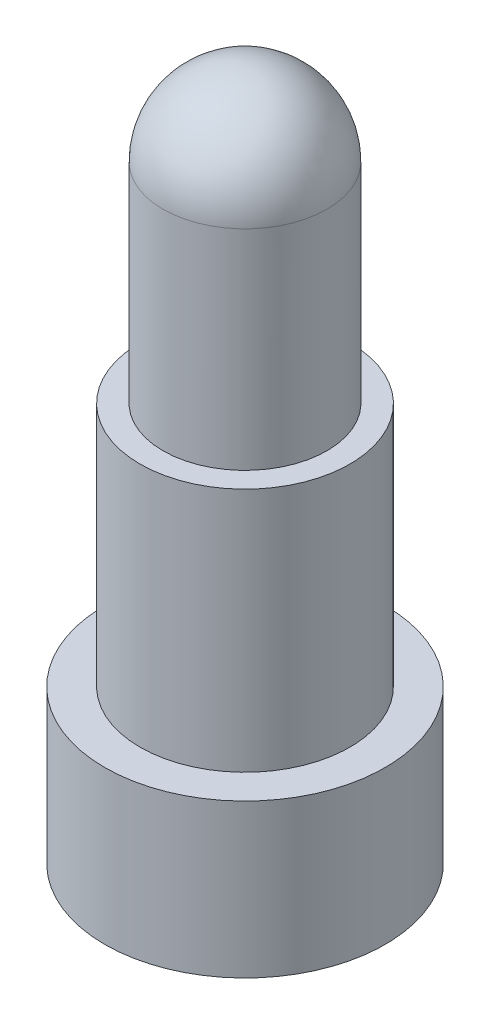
from build123d import *


with BuildPart() as part:
    # Sketch1 → Revolve1 (revolve)
    with BuildSketch(Plane.XY, mode=Mode.PRIVATE) as revolve1_sk:
        with BuildLine():
            Line((0, 0), (-0.915, 0))
            Line((-0.915, 0), (-0.915, 1))
            Line((-0.915, 1), (-0.685, 1))
            Line((-0.685, 1), (-0.685, 2.6))
            Line((-0.685, 2.6), (-0.535, 2.6))
            Line((-0.535, 2.6), (-0.535, 3.965))
            ThreePointArc((-0.535, 3.965), (-0.378302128, 4.343302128), (0, 4.5))
            Line((0, 4.5), (0, 0))
        make_face()
    revolve(revolve1_sk.sketch.rotate(Axis((0, 4.5, 0), (0, -1, 0)), 270), axis=Axis((0, 4.5, 0), (0, -1, 0)))


solid = part.part
